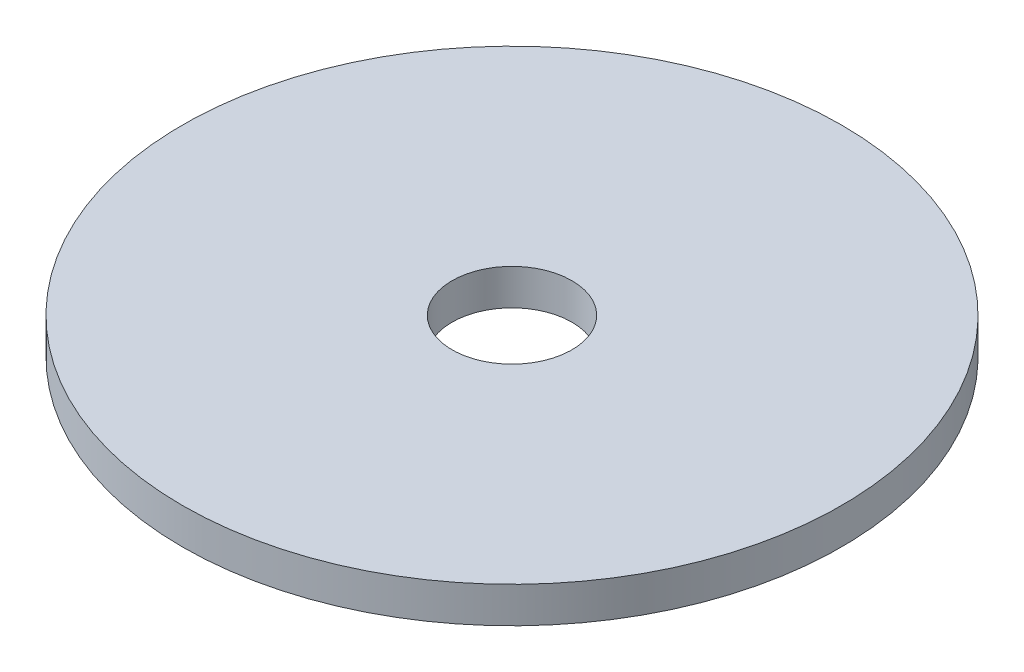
ISO-10303-21;
HEADER;
FILE_DESCRIPTION(('STEP AP214'),'2;1');
FILE_NAME('part.step','',(''),(''),'','','');
FILE_SCHEMA(('AUTOMOTIVE_DESIGN { 1 0 10303 214 1 1 1 1 }'));
ENDSEC;
DATA;
#1=APPLICATION_CONTEXT('core data for automotive mechanical design processes');
#2=APPLICATION_PROTOCOL_DEFINITION('international standard','automotive_design',2000,#1);
#3=PRODUCT_CONTEXT('',#1,'mechanical');
#4=PRODUCT('Part','Part','',(#3));
#5=PRODUCT_RELATED_PRODUCT_CATEGORY('part','',(#4));
#6=PRODUCT_DEFINITION_FORMATION('','',#4);
#7=PRODUCT_DEFINITION_CONTEXT('part definition',#1,'design');
#8=PRODUCT_DEFINITION('design','',#6,#7);
#9=PRODUCT_DEFINITION_SHAPE('','',#8);
#10=(LENGTH_UNIT() NAMED_UNIT(*) SI_UNIT(.MILLI.,.METRE.));
#11=(NAMED_UNIT(*) PLANE_ANGLE_UNIT() SI_UNIT($,.RADIAN.));
#12=(NAMED_UNIT(*) SI_UNIT($,.STERADIAN.) SOLID_ANGLE_UNIT());
#13=UNCERTAINTY_MEASURE_WITH_UNIT(LENGTH_MEASURE(1.E-05),#10,'distance_accuracy_value','');
#14=(GEOMETRIC_REPRESENTATION_CONTEXT(3) GLOBAL_UNCERTAINTY_ASSIGNED_CONTEXT((#13)) GLOBAL_UNIT_ASSIGNED_CONTEXT((#10,
#11,#12)) REPRESENTATION_CONTEXT('',''));
#15=CARTESIAN_POINT('',(0.,0.,0.));
#16=DIRECTION('',(0.,0.,1.));
#17=DIRECTION('',(1.,0.,0.));
#18=AXIS2_PLACEMENT_3D('',#15,#16,#17);
#19=CARTESIAN_POINT('',(0.,3.048,0.));
#20=DIRECTION('',(0.,1.,0.));
#21=DIRECTION('',(0.,0.,1.));
#22=AXIS2_PLACEMENT_3D('',#19,#20,#21);
#23=PLANE('',#22);
#24=CARTESIAN_POINT('',(0.,3.048,0.));
#25=DIRECTION('',(0.,1.,0.));
#26=DIRECTION('',(0.,0.,1.));
#27=AXIS2_PLACEMENT_3D('',#24,#25,#26);
#28=CIRCLE('',#27,27.94);
#29=CARTESIAN_POINT('',(0.,3.048,-27.94));
#30=VERTEX_POINT('',#29);
#31=EDGE_CURVE('E10',#30,#30,#28,.T.);
#32=ORIENTED_EDGE('',*,*,#31,.T.);
#33=EDGE_LOOP('',(#32));
#34=FACE_BOUND('',#33,.T.);
#35=CARTESIAN_POINT('',(0.,3.048,0.));
#36=DIRECTION('',(0.,1.,0.));
#37=DIRECTION('',(0.,0.,1.));
#38=AXIS2_PLACEMENT_3D('',#35,#36,#37);
#39=CIRCLE('',#38,5.08);
#40=CARTESIAN_POINT('',(0.,3.048,-5.08));
#41=VERTEX_POINT('',#40);
#42=EDGE_CURVE('E43',#41,#41,#39,.T.);
#43=ORIENTED_EDGE('',*,*,#42,.F.);
#44=EDGE_LOOP('',(#43));
#45=FACE_BOUND('',#44,.T.);
#46=ADVANCED_FACE('F32',(#34,#45),#23,.T.);
#47=CARTESIAN_POINT('',(0.,0.,0.));
#48=DIRECTION('',(0.,1.,0.));
#49=DIRECTION('',(0.,0.,1.));
#50=AXIS2_PLACEMENT_3D('',#47,#48,#49);
#51=PLANE('',#50);
#52=CARTESIAN_POINT('',(0.,0.,0.));
#53=DIRECTION('',(0.,1.,0.));
#54=DIRECTION('',(0.,0.,1.));
#55=AXIS2_PLACEMENT_3D('',#52,#53,#54);
#56=CIRCLE('',#55,27.94);
#57=CARTESIAN_POINT('',(0.,0.,-27.94));
#58=VERTEX_POINT('',#57);
#59=EDGE_CURVE('E36',#58,#58,#56,.T.);
#60=ORIENTED_EDGE('',*,*,#59,.F.);
#61=EDGE_LOOP('',(#60));
#62=FACE_BOUND('',#61,.T.);
#63=CARTESIAN_POINT('',(0.,0.,0.));
#64=DIRECTION('',(0.,1.,0.));
#65=DIRECTION('',(0.,0.,1.));
#66=AXIS2_PLACEMENT_3D('',#63,#64,#65);
#67=CIRCLE('',#66,5.08);
#68=CARTESIAN_POINT('',(0.,0.,-5.08));
#69=VERTEX_POINT('',#68);
#70=EDGE_CURVE('E45',#69,#69,#67,.T.);
#71=ORIENTED_EDGE('',*,*,#70,.T.);
#72=EDGE_LOOP('',(#71));
#73=FACE_BOUND('',#72,.T.);
#74=ADVANCED_FACE('F55',(#62,#73),#51,.F.);
#75=CARTESIAN_POINT('',(0.,3.048,0.));
#76=DIRECTION('',(0.,-1.,0.));
#77=DIRECTION('',(0.,0.,-1.));
#78=AXIS2_PLACEMENT_3D('',#75,#76,#77);
#79=CYLINDRICAL_SURFACE('',#78,27.94);
#80=CARTESIAN_POINT('',(0.,3.048,-27.94));
#81=CARTESIAN_POINT('',(0.,3.01625,-27.94));
#82=CARTESIAN_POINT('',(0.,2.9845,-27.94));
#83=CARTESIAN_POINT('',(0.,2.921,-27.94));
#84=CARTESIAN_POINT('',(0.,2.88925,-27.94));
#85=CARTESIAN_POINT('',(0.,2.82575,-27.94));
#86=CARTESIAN_POINT('',(0.,2.794,-27.94));
#87=CARTESIAN_POINT('',(0.,2.7305,-27.94));
#88=CARTESIAN_POINT('',(0.,2.69875,-27.94));
#89=CARTESIAN_POINT('',(0.,2.63525,-27.94));
#90=CARTESIAN_POINT('',(0.,2.6035,-27.94));
#91=CARTESIAN_POINT('',(0.,2.54,-27.94));
#92=CARTESIAN_POINT('',(0.,2.50825,-27.94));
#93=CARTESIAN_POINT('',(0.,2.44475,-27.94));
#94=CARTESIAN_POINT('',(0.,2.413,-27.94));
#95=CARTESIAN_POINT('',(0.,2.3495,-27.94));
#96=CARTESIAN_POINT('',(0.,2.31775,-27.94));
#97=CARTESIAN_POINT('',(0.,2.25425,-27.94));
#98=CARTESIAN_POINT('',(0.,2.2225,-27.94));
#99=CARTESIAN_POINT('',(0.,2.159,-27.94));
#100=CARTESIAN_POINT('',(0.,2.12725,-27.94));
#101=CARTESIAN_POINT('',(0.,2.06375,-27.94));
#102=CARTESIAN_POINT('',(0.,2.032,-27.94));
#103=CARTESIAN_POINT('',(0.,1.9685,-27.94));
#104=CARTESIAN_POINT('',(0.,1.93675,-27.94));
#105=CARTESIAN_POINT('',(0.,1.87325,-27.94));
#106=CARTESIAN_POINT('',(0.,1.8415,-27.94));
#107=CARTESIAN_POINT('',(0.,1.778,-27.94));
#108=CARTESIAN_POINT('',(0.,1.74625,-27.94));
#109=CARTESIAN_POINT('',(0.,1.68275,-27.94));
#110=CARTESIAN_POINT('',(0.,1.651,-27.94));
#111=CARTESIAN_POINT('',(0.,1.5875,-27.94));
#112=CARTESIAN_POINT('',(0.,1.55575,-27.94));
#113=CARTESIAN_POINT('',(0.,1.49225,-27.94));
#114=CARTESIAN_POINT('',(0.,1.4605,-27.94));
#115=CARTESIAN_POINT('',(0.,1.397,-27.94));
#116=CARTESIAN_POINT('',(0.,1.36525,-27.94));
#117=CARTESIAN_POINT('',(0.,1.30175,-27.94));
#118=CARTESIAN_POINT('',(0.,1.27,-27.94));
#119=CARTESIAN_POINT('',(0.,1.2065,-27.94));
#120=CARTESIAN_POINT('',(0.,1.17475,-27.94));
#121=CARTESIAN_POINT('',(0.,1.11125,-27.94));
#122=CARTESIAN_POINT('',(0.,1.0795,-27.94));
#123=CARTESIAN_POINT('',(0.,1.016,-27.94));
#124=CARTESIAN_POINT('',(0.,0.98425,-27.94));
#125=CARTESIAN_POINT('',(0.,0.92075,-27.94));
#126=CARTESIAN_POINT('',(0.,0.889,-27.94));
#127=CARTESIAN_POINT('',(0.,0.8255,-27.94));
#128=CARTESIAN_POINT('',(0.,0.79375,-27.94));
#129=CARTESIAN_POINT('',(0.,0.73025,-27.94));
#130=CARTESIAN_POINT('',(0.,0.6985,-27.94));
#131=CARTESIAN_POINT('',(0.,0.635,-27.94));
#132=CARTESIAN_POINT('',(0.,0.60325,-27.94));
#133=CARTESIAN_POINT('',(0.,0.53975,-27.94));
#134=CARTESIAN_POINT('',(0.,0.508,-27.94));
#135=CARTESIAN_POINT('',(0.,0.4445,-27.94));
#136=CARTESIAN_POINT('',(0.,0.41275,-27.94));
#137=CARTESIAN_POINT('',(0.,0.34925,-27.94));
#138=CARTESIAN_POINT('',(0.,0.3175,-27.94));
#139=CARTESIAN_POINT('',(0.,0.254,-27.94));
#140=CARTESIAN_POINT('',(0.,0.22225,-27.94));
#141=CARTESIAN_POINT('',(0.,0.15875,-27.94));
#142=CARTESIAN_POINT('',(0.,0.127,-27.94));
#143=CARTESIAN_POINT('',(0.,0.0634999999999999,-27.94));
#144=CARTESIAN_POINT('',(0.,0.03175,-27.94));
#145=CARTESIAN_POINT('',(0.,0.,-27.94));
#146=B_SPLINE_CURVE_WITH_KNOTS('',3,(#80,#81,#82,#83,#84,#85,#86,#87,#88,#89,#90,#91,#92,#93,
#94,#95,#96,#97,#98,#99,#100,#101,#102,#103,#104,#105,#106,#107,#108,#109,#110,#111,#112,#113,
#114,#115,#116,#117,#118,#119,#120,#121,#122,#123,#124,#125,#126,#127,#128,#129,#130,#131,#132,
#133,#134,#135,#136,#137,#138,#139,#140,#141,#142,#143,#144,#145),.UNSPECIFIED.,.F.,.F.,(4,2,2,
2,2,2,2,2,2,2,2,2,2,2,2,2,2,2,2,2,2,2,2,2,2,2,2,2,2,2,2,2,4),(0.,0.0952499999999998,0.1905,
0.28575,0.381,0.47625,0.5715,0.66675,0.762,0.85725,0.9525,1.04775,1.143,1.23825,1.3335,1.42875,
1.524,1.61925,1.7145,1.80975,1.905,2.00025,2.0955,2.19075,2.286,2.38125,2.4765,2.57175,2.667,
2.76225,2.8575,2.95275,3.048),.UNSPECIFIED.);
#147=EDGE_CURVE('BSEAM34',#30,#58,#146,.T.);
#148=ORIENTED_EDGE('',*,*,#31,.F.);
#149=ORIENTED_EDGE('',*,*,#59,.T.);
#150=ORIENTED_EDGE('',*,*,#147,.T.);
#151=ORIENTED_EDGE('',*,*,#147,.F.);
#152=EDGE_LOOP('',(#148,#150,#149,#151));
#153=FACE_BOUND('',#152,.T.);
#154=ADVANCED_FACE('F34',(#153),#79,.T.);
#155=CARTESIAN_POINT('',(0.,3.048,0.));
#156=DIRECTION('',(0.,-1.,0.));
#157=DIRECTION('',(0.,0.,-1.));
#158=AXIS2_PLACEMENT_3D('',#155,#156,#157);
#159=CYLINDRICAL_SURFACE('',#158,5.08);
#160=CARTESIAN_POINT('',(0.,3.048,-5.08));
#161=CARTESIAN_POINT('',(0.,3.01625,-5.08));
#162=CARTESIAN_POINT('',(0.,2.9845,-5.08));
#163=CARTESIAN_POINT('',(0.,2.921,-5.08));
#164=CARTESIAN_POINT('',(0.,2.88925,-5.08));
#165=CARTESIAN_POINT('',(0.,2.82575,-5.08));
#166=CARTESIAN_POINT('',(0.,2.794,-5.08));
#167=CARTESIAN_POINT('',(0.,2.7305,-5.08));
#168=CARTESIAN_POINT('',(0.,2.69875,-5.08));
#169=CARTESIAN_POINT('',(0.,2.63525,-5.08));
#170=CARTESIAN_POINT('',(0.,2.6035,-5.08));
#171=CARTESIAN_POINT('',(0.,2.54,-5.08));
#172=CARTESIAN_POINT('',(0.,2.50825,-5.08));
#173=CARTESIAN_POINT('',(0.,2.44475,-5.08));
#174=CARTESIAN_POINT('',(0.,2.413,-5.08));
#175=CARTESIAN_POINT('',(0.,2.3495,-5.08));
#176=CARTESIAN_POINT('',(0.,2.31775,-5.08));
#177=CARTESIAN_POINT('',(0.,2.25425,-5.08));
#178=CARTESIAN_POINT('',(0.,2.2225,-5.08));
#179=CARTESIAN_POINT('',(0.,2.159,-5.08));
#180=CARTESIAN_POINT('',(0.,2.12725,-5.08));
#181=CARTESIAN_POINT('',(0.,2.06375,-5.08));
#182=CARTESIAN_POINT('',(0.,2.032,-5.08));
#183=CARTESIAN_POINT('',(0.,1.9685,-5.08));
#184=CARTESIAN_POINT('',(0.,1.93675,-5.08));
#185=CARTESIAN_POINT('',(0.,1.87325,-5.08));
#186=CARTESIAN_POINT('',(0.,1.8415,-5.08));
#187=CARTESIAN_POINT('',(0.,1.778,-5.08));
#188=CARTESIAN_POINT('',(0.,1.74625,-5.08));
#189=CARTESIAN_POINT('',(0.,1.68275,-5.08));
#190=CARTESIAN_POINT('',(0.,1.651,-5.08));
#191=CARTESIAN_POINT('',(0.,1.5875,-5.08));
#192=CARTESIAN_POINT('',(0.,1.55575,-5.08));
#193=CARTESIAN_POINT('',(0.,1.49225,-5.08));
#194=CARTESIAN_POINT('',(0.,1.4605,-5.08));
#195=CARTESIAN_POINT('',(0.,1.397,-5.08));
#196=CARTESIAN_POINT('',(0.,1.36525,-5.08));
#197=CARTESIAN_POINT('',(0.,1.30175,-5.08));
#198=CARTESIAN_POINT('',(0.,1.27,-5.08));
#199=CARTESIAN_POINT('',(0.,1.2065,-5.08));
#200=CARTESIAN_POINT('',(0.,1.17475,-5.08));
#201=CARTESIAN_POINT('',(0.,1.11125,-5.08));
#202=CARTESIAN_POINT('',(0.,1.0795,-5.08));
#203=CARTESIAN_POINT('',(0.,1.016,-5.08));
#204=CARTESIAN_POINT('',(0.,0.98425,-5.08));
#205=CARTESIAN_POINT('',(0.,0.92075,-5.08));
#206=CARTESIAN_POINT('',(0.,0.889,-5.08));
#207=CARTESIAN_POINT('',(0.,0.8255,-5.08));
#208=CARTESIAN_POINT('',(0.,0.79375,-5.08));
#209=CARTESIAN_POINT('',(0.,0.73025,-5.08));
#210=CARTESIAN_POINT('',(0.,0.6985,-5.08));
#211=CARTESIAN_POINT('',(0.,0.635,-5.08));
#212=CARTESIAN_POINT('',(0.,0.60325,-5.08));
#213=CARTESIAN_POINT('',(0.,0.53975,-5.08));
#214=CARTESIAN_POINT('',(0.,0.508,-5.08));
#215=CARTESIAN_POINT('',(0.,0.4445,-5.08));
#216=CARTESIAN_POINT('',(0.,0.41275,-5.08));
#217=CARTESIAN_POINT('',(0.,0.34925,-5.08));
#218=CARTESIAN_POINT('',(0.,0.3175,-5.08));
#219=CARTESIAN_POINT('',(0.,0.254,-5.08));
#220=CARTESIAN_POINT('',(0.,0.22225,-5.08));
#221=CARTESIAN_POINT('',(0.,0.15875,-5.08));
#222=CARTESIAN_POINT('',(0.,0.127,-5.08));
#223=CARTESIAN_POINT('',(0.,0.0634999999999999,-5.08));
#224=CARTESIAN_POINT('',(0.,0.03175,-5.08));
#225=CARTESIAN_POINT('',(0.,0.,-5.08));
#226=B_SPLINE_CURVE_WITH_KNOTS('',3,(#160,#161,#162,#163,#164,#165,#166,#167,#168,#169,#170,
#171,#172,#173,#174,#175,#176,#177,#178,#179,#180,#181,#182,#183,#184,#185,#186,#187,#188,#189,
#190,#191,#192,#193,#194,#195,#196,#197,#198,#199,#200,#201,#202,#203,#204,#205,#206,#207,#208,
#209,#210,#211,#212,#213,#214,#215,#216,#217,#218,#219,#220,#221,#222,#223,#224,#225),
.UNSPECIFIED.,.F.,.F.,(4,2,2,2,2,2,2,2,2,2,2,2,2,2,2,2,2,2,2,2,2,2,2,2,2,2,2,2,2,2,2,2,4),(0.,
0.0952500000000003,0.1905,0.28575,0.381,0.47625,0.5715,0.66675,0.762,0.85725,0.9525,1.04775,
1.143,1.23825,1.3335,1.42875,1.524,1.61925,1.7145,1.80975,1.905,2.00025,2.0955,2.19075,2.286,
2.38125,2.4765,2.57175,2.667,2.76225,2.8575,2.95275,3.048),.UNSPECIFIED.);
#227=EDGE_CURVE('BSEAM51',#41,#69,#226,.T.);
#228=ORIENTED_EDGE('',*,*,#42,.T.);
#229=ORIENTED_EDGE('',*,*,#70,.F.);
#230=ORIENTED_EDGE('',*,*,#227,.T.);
#231=ORIENTED_EDGE('',*,*,#227,.F.);
#232=EDGE_LOOP('',(#228,#230,#229,#231));
#233=FACE_BOUND('',#232,.T.);
#234=ADVANCED_FACE('F51',(#233),#159,.F.);
#235=CLOSED_SHELL('',(#46,#74,#154,#234));
#236=MANIFOLD_SOLID_BREP('B2',#235);
#237=ADVANCED_BREP_SHAPE_REPRESENTATION('',(#18,#236),#14);
#238=SHAPE_DEFINITION_REPRESENTATION(#9,#237);
ENDSEC;
END-ISO-10303-21;
